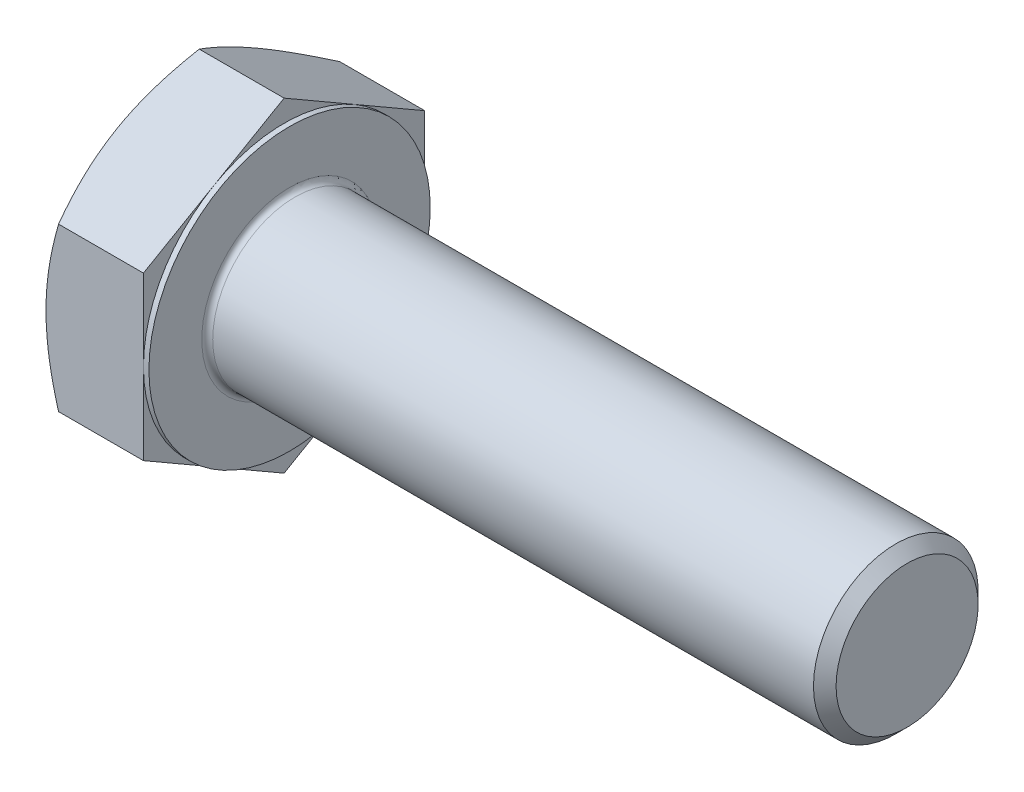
ISO-10303-21;
HEADER;
FILE_DESCRIPTION(('STEP AP214'),'2;1');
FILE_NAME('part.step','',(''),(''),'','','');
FILE_SCHEMA(('AUTOMOTIVE_DESIGN { 1 0 10303 214 1 1 1 1 }'));
ENDSEC;
DATA;
#1=APPLICATION_CONTEXT('core data for automotive mechanical design processes');
#2=APPLICATION_PROTOCOL_DEFINITION('international standard','automotive_design',2000,#1);
#3=PRODUCT_CONTEXT('',#1,'mechanical');
#4=PRODUCT('Part','Part','',(#3));
#5=PRODUCT_RELATED_PRODUCT_CATEGORY('part','',(#4));
#6=PRODUCT_DEFINITION_FORMATION('','',#4);
#7=PRODUCT_DEFINITION_CONTEXT('part definition',#1,'design');
#8=PRODUCT_DEFINITION('design','',#6,#7);
#9=PRODUCT_DEFINITION_SHAPE('','',#8);
#10=(LENGTH_UNIT() NAMED_UNIT(*) SI_UNIT(.MILLI.,.METRE.));
#11=(NAMED_UNIT(*) PLANE_ANGLE_UNIT() SI_UNIT($,.RADIAN.));
#12=(NAMED_UNIT(*) SI_UNIT($,.STERADIAN.) SOLID_ANGLE_UNIT());
#13=UNCERTAINTY_MEASURE_WITH_UNIT(LENGTH_MEASURE(1.E-05),#10,'distance_accuracy_value','');
#14=(GEOMETRIC_REPRESENTATION_CONTEXT(3) GLOBAL_UNCERTAINTY_ASSIGNED_CONTEXT((#13)) GLOBAL_UNIT_ASSIGNED_CONTEXT((#10,
#11,#12)) REPRESENTATION_CONTEXT('',''));
#15=CARTESIAN_POINT('',(0.,0.,0.));
#16=DIRECTION('',(0.,0.,1.));
#17=DIRECTION('',(1.,0.,0.));
#18=AXIS2_PLACEMENT_3D('',#15,#16,#17);
#19=CARTESIAN_POINT('',(15.,35.507041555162,-20.5));
#20=DIRECTION('',(1.,0.,0.));
#21=DIRECTION('',(0.,0.,-1.));
#22=AXIS2_PLACEMENT_3D('',#19,#20,#21);
#23=PLANE('',#22);
#24=CARTESIAN_POINT('',(15.,0.,0.));
#25=DIRECTION('',(1.,0.,0.));
#26=DIRECTION('',(0.,0.,-1.));
#27=AXIS2_PLACEMENT_3D('',#24,#25,#26);
#28=CIRCLE('',#27,12.8);
#29=CARTESIAN_POINT('',(15.,0.,-12.8));
#30=VERTEX_POINT('',#29);
#31=EDGE_CURVE('E42',#30,#30,#28,.F.);
#32=ORIENTED_EDGE('',*,*,#31,.T.);
#33=EDGE_LOOP('',(#32));
#34=FACE_BOUND('',#33,.T.);
#35=CARTESIAN_POINT('',(15.,0.,0.));
#36=DIRECTION('',(1.,0.,0.));
#37=DIRECTION('',(0.,0.,-1.));
#38=AXIS2_PLACEMENT_3D('',#35,#36,#37);
#39=CIRCLE('',#38,20.5);
#40=CARTESIAN_POINT('',(15.,0.,-20.5));
#41=VERTEX_POINT('',#40);
#42=EDGE_CURVE('E165',#41,#41,#39,.T.);
#43=ORIENTED_EDGE('',*,*,#42,.T.);
#44=EDGE_LOOP('',(#43));
#45=FACE_BOUND('',#44,.T.);
#46=ADVANCED_FACE('F34',(#34,#45),#23,.T.);
#47=CARTESIAN_POINT('',(105.,0.,0.));
#48=DIRECTION('',(-1.,0.,0.));
#49=DIRECTION('',(0.,0.,1.));
#50=AXIS2_PLACEMENT_3D('',#47,#48,#49);
#51=PLANE('',#50);
#52=CARTESIAN_POINT('',(105.,0.,0.));
#53=DIRECTION('',(-1.,0.,0.));
#54=DIRECTION('',(0.,0.,1.));
#55=AXIS2_PLACEMENT_3D('',#52,#53,#54);
#56=CIRCLE('',#55,10.352);
#57=CARTESIAN_POINT('',(105.,0.,10.352));
#58=VERTEX_POINT('',#57);
#59=EDGE_CURVE('E318',#58,#58,#56,.T.);
#60=ORIENTED_EDGE('',*,*,#59,.F.);
#61=EDGE_LOOP('',(#60));
#62=FACE_BOUND('',#61,.T.);
#63=ADVANCED_FACE('F276',(#62),#51,.F.);
#64=CARTESIAN_POINT('',(105.,0.,0.));
#65=DIRECTION('',(-1.,0.,0.));
#66=DIRECTION('',(0.,0.,1.));
#67=AXIS2_PLACEMENT_3D('',#64,#65,#66);
#68=CONICAL_SURFACE('',#67,10.352,0.78539816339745);
#69=CARTESIAN_POINT('',(103.352,0.,0.));
#70=DIRECTION('',(-1.,0.,0.));
#71=DIRECTION('',(0.,0.,1.));
#72=AXIS2_PLACEMENT_3D('',#69,#70,#71);
#73=CIRCLE('',#72,12.);
#74=CARTESIAN_POINT('',(103.352,0.,12.));
#75=VERTEX_POINT('',#74);
#76=EDGE_CURVE('E316',#75,#75,#73,.T.);
#77=ORIENTED_EDGE('',*,*,#76,.F.);
#78=EDGE_LOOP('',(#77));
#79=FACE_BOUND('',#78,.T.);
#80=ORIENTED_EDGE('',*,*,#59,.T.);
#81=EDGE_LOOP('',(#80));
#82=FACE_BOUND('',#81,.T.);
#83=ADVANCED_FACE('F281',(#79,#82),#68,.T.);
#84=CARTESIAN_POINT('',(0.,0.,0.));
#85=DIRECTION('',(-1.,0.,0.));
#86=DIRECTION('',(0.,0.,1.));
#87=AXIS2_PLACEMENT_3D('',#84,#85,#86);
#88=CYLINDRICAL_SURFACE('',#87,12.);
#89=CARTESIAN_POINT('',(15.8,0.,0.));
#90=DIRECTION('',(1.,0.,0.));
#91=DIRECTION('',(0.,0.,-1.));
#92=AXIS2_PLACEMENT_3D('',#89,#90,#91);
#93=CIRCLE('',#92,12.);
#94=CARTESIAN_POINT('',(15.8,0.,-12.));
#95=VERTEX_POINT('',#94);
#96=EDGE_CURVE('E11',#95,#95,#93,.T.);
#97=ORIENTED_EDGE('',*,*,#96,.T.);
#98=EDGE_LOOP('',(#97));
#99=FACE_BOUND('',#98,.T.);
#100=ORIENTED_EDGE('',*,*,#76,.T.);
#101=EDGE_LOOP('',(#100));
#102=FACE_BOUND('',#101,.T.);
#103=ADVANCED_FACE('F233',(#99,#102),#88,.T.);
#104=CARTESIAN_POINT('',(14.2,23.6713610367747,0.));
#105=DIRECTION('',(1.,0.,0.));
#106=DIRECTION('',(0.,0.,-1.));
#107=AXIS2_PLACEMENT_3D('',#104,#105,#106);
#108=PLANE('',#107);
#109=DIRECTION('',(0.,1.,0.));
#110=VECTOR('',#109,1.);
#111=CARTESIAN_POINT('',(14.2,-11.8356805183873,-20.5));
#112=LINE('',#111,#110);
#113=CARTESIAN_POINT('',(14.2,-11.8356805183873,-20.5));
#114=VERTEX_POINT('',#113);
#115=CARTESIAN_POINT('',(14.2,0.,-20.5));
#116=VERTEX_POINT('',#115);
#117=EDGE_CURVE('E190',#114,#116,#112,.T.);
#118=ORIENTED_EDGE('',*,*,#117,.T.);
#119=CARTESIAN_POINT('',(14.2,0.,0.));
#120=DIRECTION('',(-1.,0.,0.));
#121=DIRECTION('',(0.,0.,1.));
#122=AXIS2_PLACEMENT_3D('',#119,#120,#121);
#123=CIRCLE('',#122,20.5);
#124=CARTESIAN_POINT('',(14.2,-17.753520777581,-10.25));
#125=VERTEX_POINT('',#124);
#126=EDGE_CURVE('E49',#116,#125,#123,.T.);
#127=ORIENTED_EDGE('',*,*,#126,.T.);
#128=DIRECTION('',(0.,0.5,-0.866025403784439));
#129=VECTOR('',#128,1.);
#130=CARTESIAN_POINT('',(14.2,-23.6713610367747,0.));
#131=LINE('',#130,#129);
#132=EDGE_CURVE('E168',#125,#114,#131,.T.);
#133=ORIENTED_EDGE('',*,*,#132,.T.);
#134=EDGE_LOOP('',(#118,#127,#133));
#135=FACE_BOUND('',#134,.T.);
#136=ADVANCED_FACE('F189',(#135),#108,.T.);
#137=CARTESIAN_POINT('',(14.2,11.8356805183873,-20.5));
#138=VERTEX_POINT('',#137);
#139=EDGE_CURVE('E197',#116,#138,#112,.T.);
#140=ORIENTED_EDGE('',*,*,#139,.T.);
#141=DIRECTION('',(0.,0.5,0.866025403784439));
#142=VECTOR('',#141,1.);
#143=CARTESIAN_POINT('',(14.2,11.8356805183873,-20.5));
#144=LINE('',#143,#142);
#145=CARTESIAN_POINT('',(14.2,17.753520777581,-10.25));
#146=VERTEX_POINT('',#145);
#147=EDGE_CURVE('E203',#138,#146,#144,.T.);
#148=ORIENTED_EDGE('',*,*,#147,.T.);
#149=EDGE_CURVE('E336',#146,#116,#123,.T.);
#150=ORIENTED_EDGE('',*,*,#149,.T.);
#151=EDGE_LOOP('',(#140,#148,#150));
#152=FACE_BOUND('',#151,.T.);
#153=ADVANCED_FACE('F340',(#152),#108,.T.);
#154=CARTESIAN_POINT('',(14.2,23.6713610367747,0.));
#155=VERTEX_POINT('',#154);
#156=EDGE_CURVE('E205',#146,#155,#144,.T.);
#157=ORIENTED_EDGE('',*,*,#156,.T.);
#158=DIRECTION('',(0.,-0.5,0.866025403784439));
#159=VECTOR('',#158,1.);
#160=CARTESIAN_POINT('',(14.2,23.6713610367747,0.));
#161=LINE('',#160,#159);
#162=CARTESIAN_POINT('',(14.2,17.753520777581,10.25));
#163=VERTEX_POINT('',#162);
#164=EDGE_CURVE('E135',#155,#163,#161,.T.);
#165=ORIENTED_EDGE('',*,*,#164,.T.);
#166=EDGE_CURVE('E333',#163,#146,#123,.T.);
#167=ORIENTED_EDGE('',*,*,#166,.T.);
#168=EDGE_LOOP('',(#157,#165,#167));
#169=FACE_BOUND('',#168,.T.);
#170=ADVANCED_FACE('F346',(#169),#108,.T.);
#171=CARTESIAN_POINT('',(14.2,11.8356805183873,20.5));
#172=VERTEX_POINT('',#171);
#173=EDGE_CURVE('E125',#163,#172,#161,.T.);
#174=ORIENTED_EDGE('',*,*,#173,.T.);
#175=DIRECTION('',(0.,-1.,0.));
#176=VECTOR('',#175,1.);
#177=CARTESIAN_POINT('',(14.2,11.8356805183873,20.5));
#178=LINE('',#177,#176);
#179=CARTESIAN_POINT('',(14.2,0.,20.5));
#180=VERTEX_POINT('',#179);
#181=EDGE_CURVE('E128',#172,#180,#178,.T.);
#182=ORIENTED_EDGE('',*,*,#181,.T.);
#183=EDGE_CURVE('E131',#180,#163,#123,.T.);
#184=ORIENTED_EDGE('',*,*,#183,.T.);
#185=EDGE_LOOP('',(#174,#182,#184));
#186=FACE_BOUND('',#185,.T.);
#187=ADVANCED_FACE('F127',(#186),#108,.T.);
#188=CARTESIAN_POINT('',(14.2,-11.8356805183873,20.5));
#189=VERTEX_POINT('',#188);
#190=EDGE_CURVE('E144',#180,#189,#178,.T.);
#191=ORIENTED_EDGE('',*,*,#190,.T.);
#192=DIRECTION('',(0.,-0.5,-0.866025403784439));
#193=VECTOR('',#192,1.);
#194=CARTESIAN_POINT('',(14.2,-11.8356805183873,20.5));
#195=LINE('',#194,#193);
#196=CARTESIAN_POINT('',(14.2,-17.753520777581,10.25));
#197=VERTEX_POINT('',#196);
#198=EDGE_CURVE('E328',#189,#197,#195,.T.);
#199=ORIENTED_EDGE('',*,*,#198,.T.);
#200=EDGE_CURVE('E334',#197,#180,#123,.T.);
#201=ORIENTED_EDGE('',*,*,#200,.T.);
#202=EDGE_LOOP('',(#191,#199,#201));
#203=FACE_BOUND('',#202,.T.);
#204=ADVANCED_FACE('F409',(#203),#108,.T.);
#205=CARTESIAN_POINT('',(14.2,-23.6713610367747,0.));
#206=VERTEX_POINT('',#205);
#207=EDGE_CURVE('E181',#197,#206,#195,.T.);
#208=ORIENTED_EDGE('',*,*,#207,.T.);
#209=EDGE_CURVE('E169',#206,#125,#131,.T.);
#210=ORIENTED_EDGE('',*,*,#209,.T.);
#211=EDGE_CURVE('E179',#125,#197,#123,.T.);
#212=ORIENTED_EDGE('',*,*,#211,.T.);
#213=EDGE_LOOP('',(#208,#210,#212));
#214=FACE_BOUND('',#213,.T.);
#215=ADVANCED_FACE('F178',(#214),#108,.T.);
#216=CARTESIAN_POINT('',(0.,0.,0.));
#217=DIRECTION('',(-1.,0.,0.));
#218=DIRECTION('',(0.,0.,1.));
#219=AXIS2_PLACEMENT_3D('',#216,#217,#218);
#220=CYLINDRICAL_SURFACE('',#219,20.5);
#221=ORIENTED_EDGE('',*,*,#126,.F.);
#222=ORIENTED_EDGE('',*,*,#149,.F.);
#223=ORIENTED_EDGE('',*,*,#166,.F.);
#224=ORIENTED_EDGE('',*,*,#183,.F.);
#225=ORIENTED_EDGE('',*,*,#200,.F.);
#226=ORIENTED_EDGE('',*,*,#211,.F.);
#227=EDGE_LOOP('',(#221,#222,#223,#224,#225,#226));
#228=FACE_BOUND('',#227,.T.);
#229=ORIENTED_EDGE('',*,*,#42,.F.);
#230=EDGE_LOOP('',(#229));
#231=FACE_BOUND('',#230,.T.);
#232=ADVANCED_FACE('F288',(#228,#231),#220,.T.);
#233=CARTESIAN_POINT('',(0.,35.507041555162,-20.5));
#234=DIRECTION('',(1.,0.,0.));
#235=DIRECTION('',(0.,0.,-1.));
#236=AXIS2_PLACEMENT_3D('',#233,#234,#235);
#237=PLANE('',#236);
#238=CARTESIAN_POINT('',(0.,0.,0.));
#239=DIRECTION('',(1.,0.,0.));
#240=DIRECTION('',(0.,0.,-1.));
#241=AXIS2_PLACEMENT_3D('',#238,#239,#240);
#242=CIRCLE('',#241,20.5);
#243=CARTESIAN_POINT('',(0.,0.,-20.5));
#244=VERTEX_POINT('',#243);
#245=CARTESIAN_POINT('',(0.,17.753520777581,-10.25));
#246=VERTEX_POINT('',#245);
#247=EDGE_CURVE('E164',#244,#246,#242,.T.);
#248=ORIENTED_EDGE('',*,*,#247,.F.);
#249=CARTESIAN_POINT('',(0.,-17.753520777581,-10.25));
#250=VERTEX_POINT('',#249);
#251=EDGE_CURVE('E160',#250,#244,#242,.T.);
#252=ORIENTED_EDGE('',*,*,#251,.F.);
#253=CARTESIAN_POINT('',(0.,-17.753520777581,10.25));
#254=VERTEX_POINT('',#253);
#255=EDGE_CURVE('E163',#254,#250,#242,.T.);
#256=ORIENTED_EDGE('',*,*,#255,.F.);
#257=CARTESIAN_POINT('',(0.,0.,20.5));
#258=VERTEX_POINT('',#257);
#259=EDGE_CURVE('E522',#258,#254,#242,.T.);
#260=ORIENTED_EDGE('',*,*,#259,.F.);
#261=CARTESIAN_POINT('',(0.,0.,0.));
#262=DIRECTION('',(-1.,0.,0.));
#263=DIRECTION('',(0.,0.,1.));
#264=AXIS2_PLACEMENT_3D('',#261,#262,#263);
#265=CIRCLE('',#264,20.5);
#266=CARTESIAN_POINT('',(0.,17.753520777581,10.25));
#267=VERTEX_POINT('',#266);
#268=EDGE_CURVE('E198',#258,#267,#265,.T.);
#269=ORIENTED_EDGE('',*,*,#268,.T.);
#270=EDGE_CURVE('E300',#246,#267,#242,.T.);
#271=ORIENTED_EDGE('',*,*,#270,.F.);
#272=EDGE_LOOP('',(#248,#252,#256,#260,#269,#271));
#273=FACE_BOUND('',#272,.T.);
#274=ADVANCED_FACE('F285',(#273),#237,.F.);
#275=CARTESIAN_POINT('',(0.,0.,0.));
#276=DIRECTION('',(1.,0.,0.));
#277=DIRECTION('',(0.,0.,-1.));
#278=AXIS2_PLACEMENT_3D('',#275,#276,#277);
#279=CONICAL_SURFACE('',#278,20.5,1.0471975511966);
#280=CARTESIAN_POINT('',(1.83105281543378,23.6714765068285,0.000199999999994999));
#281=CARTESIAN_POINT('',(1.68086967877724,23.4113332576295,-0.450381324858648));
#282=CARTESIAN_POINT('',(1.53750164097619,23.1501753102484,-0.902720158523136));
#283=CARTESIAN_POINT('',(1.26629011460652,22.6257652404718,-1.81102504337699));
#284=CARTESIAN_POINT('',(1.13845173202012,22.3625124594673,-2.26699223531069));
#285=CARTESIAN_POINT('',(0.90001793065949,21.8334039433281,-3.1834350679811));
#286=CARTESIAN_POINT('',(0.789463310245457,21.5675435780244,-3.6439187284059));
#287=CARTESIAN_POINT('',(0.587971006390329,21.0339755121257,-4.5680857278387));
#288=CARTESIAN_POINT('',(0.497032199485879,20.7662679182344,-5.03176888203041));
#289=CARTESIAN_POINT('',(0.338639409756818,20.2358649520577,-5.95045376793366));
#290=CARTESIAN_POINT('',(0.270661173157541,19.9732089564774,-6.40538729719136));
#291=CARTESIAN_POINT('',(0.156677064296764,19.4466934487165,-7.3173389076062));
#292=CARTESIAN_POINT('',(0.110671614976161,19.1828339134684,-7.77435702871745));
#293=CARTESIAN_POINT('',(0.0417946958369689,18.6546716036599,-8.68916098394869));
#294=CARTESIAN_POINT('',(0.0188957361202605,18.3903697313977,-9.14694525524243));
#295=CARTESIAN_POINT('',(-0.00327576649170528,17.8615220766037,-10.0629362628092));
#296=CARTESIAN_POINT('',(-0.00254903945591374,17.5969763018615,-10.5211429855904));
#297=CARTESIAN_POINT('',(0.020880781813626,17.1024027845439,-11.3777694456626));
#298=CARTESIAN_POINT('',(0.0407268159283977,16.8723398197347,-11.776250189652));
#299=CARTESIAN_POINT('',(0.0979103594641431,16.412763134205,-12.5722603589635));
#300=CARTESIAN_POINT('',(0.135247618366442,16.1832494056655,-12.9697897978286));
#301=CARTESIAN_POINT('',(0.226766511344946,15.7248559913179,-13.7637504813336));
#302=CARTESIAN_POINT('',(0.280963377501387,15.4959770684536,-14.1601804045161));
#303=CARTESIAN_POINT('',(0.405242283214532,15.0393151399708,-14.9511420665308));
#304=CARTESIAN_POINT('',(0.475324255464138,14.8115321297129,-15.3456738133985));
#305=CARTESIAN_POINT('',(0.711196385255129,14.120031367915,-16.5433882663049));
#306=CARTESIAN_POINT('',(0.900518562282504,13.6582783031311,-17.3431680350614));
#307=CARTESIAN_POINT('',(1.22283076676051,12.9707481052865,-18.5340052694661));
#308=CARTESIAN_POINT('',(1.33654034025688,12.7426182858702,-18.9291377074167));
#309=CARTESIAN_POINT('',(1.57547119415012,12.2879365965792,-19.7166694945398));
#310=CARTESIAN_POINT('',(1.70068922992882,12.0613843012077,-20.1090695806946));
#311=CARTESIAN_POINT('',(1.83105281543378,11.8355650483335,-20.5002));
#312=B_SPLINE_CURVE_WITH_KNOTS('',3,(#280,#281,#282,#283,#284,#285,#286,#287,#288,#289,#290,
#291,#292,#293,#294,#295,#296,#297,#298,#299,#300,#301,#302,#303,#304,#305,#306,#307,#308,#309,
#310,#311),.UNSPECIFIED.,.F.,.F.,(4,2,2,2,2,2,2,2,2,2,2,2,2,2,2,4),(0.,1.62462772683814,
3.24978817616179,4.87872871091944,6.50757592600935,8.09621981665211,9.68489428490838,
11.2716764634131,12.8584096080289,14.2397371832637,15.6210449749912,17.0036043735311,
18.3861579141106,21.2121645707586,22.6227063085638,24.0328515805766),.UNSPECIFIED.);
#313=CARTESIAN_POINT('',(1.83098614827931,11.8356805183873,-20.5));
#314=VERTEX_POINT('',#313);
#315=EDGE_CURVE('E252',#246,#314,#312,.T.);
#316=ORIENTED_EDGE('',*,*,#315,.T.);
#317=CARTESIAN_POINT('',(9.80979745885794,-31.3899689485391,-20.5));
#318=CARTESIAN_POINT('',(9.59226627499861,-30.9399526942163,-20.5));
#319=CARTESIAN_POINT('',(9.37586091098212,-30.4893925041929,-20.5));
#320=CARTESIAN_POINT('',(8.94556023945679,-29.5870693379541,-20.5));
#321=CARTESIAN_POINT('',(8.73166495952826,-29.1353063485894,-20.5));
#322=CARTESIAN_POINT('',(8.09406991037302,-27.7779085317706,-20.5));
#323=CARTESIAN_POINT('',(7.67453183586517,-26.870311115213,-20.5));
#324=CARTESIAN_POINT('',(6.84686142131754,-25.0436509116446,-20.5));
#325=CARTESIAN_POINT('',(6.43880809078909,-24.1245522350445,-20.5));
#326=CARTESIAN_POINT('',(5.64022131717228,-22.2788016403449,-20.5));
#327=CARTESIAN_POINT('',(5.24968696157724,-21.3521501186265,-20.5));
#328=CARTESIAN_POINT('',(4.48617156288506,-19.4783167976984,-20.5));
#329=CARTESIAN_POINT('',(4.1134648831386,-18.5310226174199,-20.5));
#330=CARTESIAN_POINT('',(3.3972405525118,-16.625254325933,-20.5));
#331=CARTESIAN_POINT('',(3.05372614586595,-15.6667789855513,-20.5));
#332=CARTESIAN_POINT('',(2.40512113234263,-13.7391236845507,-20.5));
#333=CARTESIAN_POINT('',(2.09994883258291,-12.7699714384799,-20.5));
#334=CARTESIAN_POINT('',(1.53792390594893,-10.8177954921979,-20.5));
#335=CARTESIAN_POINT('',(1.28105601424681,-9.83477628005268,-20.5));
#336=CARTESIAN_POINT('',(0.941385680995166,-8.34966043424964,-20.5));
#337=CARTESIAN_POINT('',(0.835750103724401,-7.8527518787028,-20.5));
#338=CARTESIAN_POINT('',(0.641357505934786,-6.85562756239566,-20.5));
#339=CARTESIAN_POINT('',(0.552600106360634,-6.35541187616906,-20.5));
#340=CARTESIAN_POINT('',(0.393537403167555,-5.35200901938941,-20.5));
#341=CARTESIAN_POINT('',(0.323233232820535,-4.84882166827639,-20.5));
#342=CARTESIAN_POINT('',(0.202489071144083,-3.84005205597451,-20.5));
#343=CARTESIAN_POINT('',(0.15204910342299,-3.33446979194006,-20.5));
#344=CARTESIAN_POINT('',(0.0723912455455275,-2.32485722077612,-20.5));
#345=CARTESIAN_POINT('',(0.0430405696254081,-1.82083745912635,-20.5));
#346=CARTESIAN_POINT('',(0.00571561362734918,-0.812009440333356,-20.5));
#347=CARTESIAN_POINT('',(-0.00225898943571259,-0.307201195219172,-20.5));
#348=CARTESIAN_POINT('',(0.00335727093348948,0.702157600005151,-20.5));
#349=CARTESIAN_POINT('',(0.0169421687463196,1.20670818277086,-20.5));
#350=CARTESIAN_POINT('',(0.0653398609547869,2.21479394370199,-20.5));
#351=CARTESIAN_POINT('',(0.100153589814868,2.71832907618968,-20.5));
#352=CARTESIAN_POINT('',(0.209497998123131,3.93836780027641,-20.5));
#353=CARTESIAN_POINT('',(0.294643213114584,4.65393563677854,-20.5));
#354=CARTESIAN_POINT('',(0.503069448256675,6.07950291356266,-20.5));
#355=CARTESIAN_POINT('',(0.626356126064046,6.78950151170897,-20.5));
#356=CARTESIAN_POINT('',(0.906871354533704,8.20429219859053,-20.5));
#357=CARTESIAN_POINT('',(1.06417266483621,8.90906972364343,-20.5));
#358=CARTESIAN_POINT('',(1.40783262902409,10.3114091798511,-20.5));
#359=CARTESIAN_POINT('',(1.59419019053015,11.0089713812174,-20.5));
#360=CARTESIAN_POINT('',(1.99616156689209,12.4133077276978,-20.5));
#361=CARTESIAN_POINT('',(2.21235967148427,13.1199134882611,-20.5));
#362=CARTESIAN_POINT('',(2.66628065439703,14.5262025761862,-20.5));
#363=CARTESIAN_POINT('',(2.90400547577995,15.225885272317,-20.5));
#364=CARTESIAN_POINT('',(3.39595115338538,16.614963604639,-20.5));
#365=CARTESIAN_POINT('',(3.65007142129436,17.3043950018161,-20.5));
#366=CARTESIAN_POINT('',(4.04225268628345,18.3341949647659,-20.5));
#367=CARTESIAN_POINT('',(4.1747910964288,18.6766824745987,-20.5));
#368=CARTESIAN_POINT('',(4.44323659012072,19.3603241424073,-20.5));
#369=CARTESIAN_POINT('',(4.57914357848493,19.7014783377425,-20.5));
#370=CARTESIAN_POINT('',(4.71658365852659,20.0420145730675,-20.5));
#371=B_SPLINE_CURVE_WITH_KNOTS('',3,(#317,#318,#319,#320,#321,#322,#323,#324,#325,#326,#327,
#328,#329,#330,#331,#332,#333,#334,#335,#336,#337,#338,#339,#340,#341,#342,#343,#344,#345,#346,
#347,#348,#349,#350,#351,#352,#353,#354,#355,#356,#357,#358,#359,#360,#361,#362,#363,#364,#365,
#366,#367,#368,#369,#370),.UNSPECIFIED.,.F.,.F.,(4,2,2,2,2,2,2,2,2,2,2,2,2,2,2,2,2,2,2,2,2,2,2,
2,2,2,4),(0.,1.4995003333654,2.99901712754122,5.99853830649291,9.01522453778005,
12.0317534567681,15.0853160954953,18.139217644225,21.1864979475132,24.232813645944,
25.7566114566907,27.2803750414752,28.804232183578,30.3280911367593,31.8422691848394,
33.35642435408,34.870160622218,36.3839635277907,38.5446079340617,40.7055729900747,
42.8712070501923,45.0367597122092,47.2531694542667,49.4697794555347,51.6738890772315,
52.7755902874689,53.8772604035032),.UNSPECIFIED.);
#372=EDGE_CURVE('E303',#314,#244,#371,.F.);
#373=ORIENTED_EDGE('',*,*,#372,.T.);
#374=ORIENTED_EDGE('',*,*,#247,.T.);
#375=EDGE_LOOP('',(#316,#373,#374));
#376=FACE_BOUND('',#375,.T.);
#377=ADVANCED_FACE('F287',(#376),#279,.T.);
#378=CARTESIAN_POINT('',(1.83105281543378,11.8355650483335,20.5002));
#379=CARTESIAN_POINT('',(1.68086967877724,12.0957082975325,20.0496186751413));
#380=CARTESIAN_POINT('',(1.53750164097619,12.3568662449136,19.5972798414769));
#381=CARTESIAN_POINT('',(1.26629011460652,12.8812763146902,18.688974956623));
#382=CARTESIAN_POINT('',(1.13845173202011,13.1445290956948,18.2330077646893));
#383=CARTESIAN_POINT('',(0.900017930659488,13.6736376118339,17.3165649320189));
#384=CARTESIAN_POINT('',(0.789463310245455,13.9394979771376,16.8560812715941));
#385=CARTESIAN_POINT('',(0.587971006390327,14.4730660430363,15.9319142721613));
#386=CARTESIAN_POINT('',(0.497032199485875,14.7407736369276,15.4682311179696));
#387=CARTESIAN_POINT('',(0.338639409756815,15.2711766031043,14.5495462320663));
#388=CARTESIAN_POINT('',(0.27066117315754,15.5338325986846,14.0946127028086));
#389=CARTESIAN_POINT('',(0.156677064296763,16.0603481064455,13.1826610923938));
#390=CARTESIAN_POINT('',(0.110671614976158,16.3242076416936,12.7256429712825));
#391=CARTESIAN_POINT('',(0.0417946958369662,16.8523699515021,11.8108390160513));
#392=CARTESIAN_POINT('',(0.018895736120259,17.1166718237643,11.3530547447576));
#393=CARTESIAN_POINT('',(-0.00327576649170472,17.6455194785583,10.4370637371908));
#394=CARTESIAN_POINT('',(-0.00254903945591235,17.9100652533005,9.97885701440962));
#395=CARTESIAN_POINT('',(0.0208807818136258,18.4046387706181,9.12223055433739));
#396=CARTESIAN_POINT('',(0.0407268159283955,18.6347017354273,8.72374981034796));
#397=CARTESIAN_POINT('',(0.0979103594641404,19.094278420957,7.92773964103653));
#398=CARTESIAN_POINT('',(0.135247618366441,19.3237921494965,7.5302102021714));
#399=CARTESIAN_POINT('',(0.226766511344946,19.7821855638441,6.73624951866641));
#400=CARTESIAN_POINT('',(0.280963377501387,20.0110644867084,6.33981959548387));
#401=CARTESIAN_POINT('',(0.405242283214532,20.4677264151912,5.54885793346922));
#402=CARTESIAN_POINT('',(0.475324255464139,20.6955094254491,5.15432618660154));
#403=CARTESIAN_POINT('',(0.71119638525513,21.387010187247,3.95661173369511));
#404=CARTESIAN_POINT('',(0.900518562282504,21.8487632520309,3.1568319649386));
#405=CARTESIAN_POINT('',(1.2228307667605,22.5362934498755,1.96599473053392));
#406=CARTESIAN_POINT('',(1.33654034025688,22.7644232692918,1.57086229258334));
#407=CARTESIAN_POINT('',(1.57547119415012,23.2191049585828,0.78333050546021));
#408=CARTESIAN_POINT('',(1.70068922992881,23.4456572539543,0.390930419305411));
#409=CARTESIAN_POINT('',(1.83105281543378,23.6714765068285,-0.000200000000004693));
#410=B_SPLINE_CURVE_WITH_KNOTS('',3,(#378,#379,#380,#381,#382,#383,#384,#385,#386,#387,#388,
#389,#390,#391,#392,#393,#394,#395,#396,#397,#398,#399,#400,#401,#402,#403,#404,#405,#406,#407,
#408,#409),.UNSPECIFIED.,.F.,.F.,(4,2,2,2,2,2,2,2,2,2,2,2,2,2,2,4),(0.,1.62462772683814,
3.24978817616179,4.87872871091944,6.50757592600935,8.09621981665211,9.68489428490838,
11.2716764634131,12.8584096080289,14.2397371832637,15.6210449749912,17.0036043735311,
18.3861579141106,21.2121645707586,22.6227063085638,24.0328515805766),.UNSPECIFIED.);
#411=CARTESIAN_POINT('',(1.83098614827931,23.6713610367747,0.));
#412=VERTEX_POINT('',#411);
#413=EDGE_CURVE('E258',#267,#412,#410,.T.);
#414=ORIENTED_EDGE('',*,*,#413,.T.);
#415=EDGE_CURVE('E57',#412,#246,#312,.T.);
#416=ORIENTED_EDGE('',*,*,#415,.T.);
#417=ORIENTED_EDGE('',*,*,#270,.T.);
#418=EDGE_LOOP('',(#414,#416,#417));
#419=FACE_BOUND('',#418,.T.);
#420=ADVANCED_FACE('F229',(#419),#279,.T.);
#421=CARTESIAN_POINT('',(1.83098614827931,11.8356805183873,20.5));
#422=VERTEX_POINT('',#421);
#423=EDGE_CURVE('E149',#422,#267,#410,.T.);
#424=ORIENTED_EDGE('',*,*,#423,.T.);
#425=ORIENTED_EDGE('',*,*,#268,.F.);
#426=CARTESIAN_POINT('',(9.80979745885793,-31.3899689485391,20.5));
#427=CARTESIAN_POINT('',(9.5922662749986,-30.9399526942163,20.5));
#428=CARTESIAN_POINT('',(9.37586091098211,-30.4893925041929,20.5));
#429=CARTESIAN_POINT('',(8.94556023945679,-29.5870693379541,20.5));
#430=CARTESIAN_POINT('',(8.73166495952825,-29.1353063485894,20.5));
#431=CARTESIAN_POINT('',(8.09406991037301,-27.7779085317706,20.5));
#432=CARTESIAN_POINT('',(7.67453183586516,-26.870311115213,20.5));
#433=CARTESIAN_POINT('',(6.84686142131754,-25.0436509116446,20.5));
#434=CARTESIAN_POINT('',(6.43880809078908,-24.1245522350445,20.5));
#435=CARTESIAN_POINT('',(5.64022131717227,-22.2788016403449,20.5));
#436=CARTESIAN_POINT('',(5.24968696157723,-21.3521501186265,20.5));
#437=CARTESIAN_POINT('',(4.48617156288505,-19.4783167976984,20.5));
#438=CARTESIAN_POINT('',(4.11346488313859,-18.5310226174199,20.5));
#439=CARTESIAN_POINT('',(3.39724055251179,-16.625254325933,20.5));
#440=CARTESIAN_POINT('',(3.05372614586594,-15.6667789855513,20.5));
#441=CARTESIAN_POINT('',(2.40512113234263,-13.7391236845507,20.5));
#442=CARTESIAN_POINT('',(2.0999488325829,-12.7699714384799,20.5));
#443=CARTESIAN_POINT('',(1.53792390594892,-10.8177954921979,20.5));
#444=CARTESIAN_POINT('',(1.2810560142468,-9.83477628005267,20.5));
#445=CARTESIAN_POINT('',(0.94138568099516,-8.34966043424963,20.5));
#446=CARTESIAN_POINT('',(0.835750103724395,-7.85275187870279,20.5));
#447=CARTESIAN_POINT('',(0.64135750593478,-6.85562756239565,20.5));
#448=CARTESIAN_POINT('',(0.552600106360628,-6.35541187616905,20.5));
#449=CARTESIAN_POINT('',(0.39353740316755,-5.35200901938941,20.5));
#450=CARTESIAN_POINT('',(0.323233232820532,-4.84882166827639,20.5));
#451=CARTESIAN_POINT('',(0.202489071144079,-3.84005205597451,20.5));
#452=CARTESIAN_POINT('',(0.152049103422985,-3.33446979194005,20.5));
#453=CARTESIAN_POINT('',(0.0723912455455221,-2.32485722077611,20.5));
#454=CARTESIAN_POINT('',(0.0430405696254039,-1.82083745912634,20.5));
#455=CARTESIAN_POINT('',(0.00571561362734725,-0.812009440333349,20.5));
#456=CARTESIAN_POINT('',(-0.00225898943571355,-0.307201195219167,20.5));
#457=CARTESIAN_POINT('',(0.00335727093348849,0.702157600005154,20.5));
#458=CARTESIAN_POINT('',(0.0169421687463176,1.20670818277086,20.5));
#459=CARTESIAN_POINT('',(0.0653398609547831,2.21479394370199,20.5));
#460=CARTESIAN_POINT('',(0.100153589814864,2.71832907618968,20.5));
#461=CARTESIAN_POINT('',(0.209497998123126,3.93836780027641,20.5));
#462=CARTESIAN_POINT('',(0.294643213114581,4.65393563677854,20.5));
#463=CARTESIAN_POINT('',(0.503069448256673,6.07950291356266,20.5));
#464=CARTESIAN_POINT('',(0.626356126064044,6.78950151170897,20.5));
#465=CARTESIAN_POINT('',(0.906871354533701,8.20429219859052,20.5));
#466=CARTESIAN_POINT('',(1.06417266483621,8.90906972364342,20.5));
#467=CARTESIAN_POINT('',(1.40783262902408,10.3114091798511,20.5));
#468=CARTESIAN_POINT('',(1.59419019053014,11.0089713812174,20.5));
#469=CARTESIAN_POINT('',(1.99616156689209,12.4133077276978,20.5));
#470=CARTESIAN_POINT('',(2.21235967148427,13.1199134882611,20.5));
#471=CARTESIAN_POINT('',(2.66628065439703,14.5262025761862,20.5));
#472=CARTESIAN_POINT('',(2.90400547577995,15.225885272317,20.5));
#473=CARTESIAN_POINT('',(3.39595115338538,16.614963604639,20.5));
#474=CARTESIAN_POINT('',(3.65007142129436,17.3043950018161,20.5));
#475=CARTESIAN_POINT('',(4.04225268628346,18.3341949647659,20.5));
#476=CARTESIAN_POINT('',(4.1747910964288,18.6766824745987,20.5));
#477=CARTESIAN_POINT('',(4.44323659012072,19.3603241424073,20.5));
#478=CARTESIAN_POINT('',(4.57914357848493,19.7014783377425,20.5));
#479=CARTESIAN_POINT('',(4.71658365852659,20.0420145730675,20.5));
#480=B_SPLINE_CURVE_WITH_KNOTS('',3,(#426,#427,#428,#429,#430,#431,#432,#433,#434,#435,#436,
#437,#438,#439,#440,#441,#442,#443,#444,#445,#446,#447,#448,#449,#450,#451,#452,#453,#454,#455,
#456,#457,#458,#459,#460,#461,#462,#463,#464,#465,#466,#467,#468,#469,#470,#471,#472,#473,#474,
#475,#476,#477,#478,#479),.UNSPECIFIED.,.F.,.F.,(4,2,2,2,2,2,2,2,2,2,2,2,2,2,2,2,2,2,2,2,2,2,2,
2,2,2,4),(0.,1.4995003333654,2.99901712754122,5.99853830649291,9.01522453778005,
12.0317534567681,15.0853160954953,18.139217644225,21.1864979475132,24.2328136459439,
25.7566114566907,27.2803750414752,28.804232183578,30.3280911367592,31.8422691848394,
33.35642435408,34.870160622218,36.3839635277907,38.5446079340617,40.7055729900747,
42.8712070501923,45.0367597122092,47.2531694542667,49.4697794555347,51.6738890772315,
52.7755902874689,53.8772604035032),.UNSPECIFIED.);
#481=EDGE_CURVE('E314',#258,#422,#480,.T.);
#482=ORIENTED_EDGE('',*,*,#481,.T.);
#483=EDGE_LOOP('',(#424,#425,#482));
#484=FACE_BOUND('',#483,.T.);
#485=ADVANCED_FACE('F223',(#484),#279,.T.);
#486=CARTESIAN_POINT('',(1.83098614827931,-11.8356805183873,20.5));
#487=VERTEX_POINT('',#486);
#488=EDGE_CURVE('E246',#487,#258,#480,.T.);
#489=ORIENTED_EDGE('',*,*,#488,.T.);
#490=ORIENTED_EDGE('',*,*,#259,.T.);
#491=CARTESIAN_POINT('',(1.83105281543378,-23.6714765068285,-0.000200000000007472));
#492=CARTESIAN_POINT('',(1.68086967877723,-23.4113332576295,0.450381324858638));
#493=CARTESIAN_POINT('',(1.53750164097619,-23.1501753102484,0.902720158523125));
#494=CARTESIAN_POINT('',(1.26629011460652,-22.6257652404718,1.81102504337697));
#495=CARTESIAN_POINT('',(1.13845173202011,-22.3625124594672,2.26699223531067));
#496=CARTESIAN_POINT('',(0.900017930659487,-21.8334039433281,3.18343506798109));
#497=CARTESIAN_POINT('',(0.789463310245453,-21.5675435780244,3.64391872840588));
#498=CARTESIAN_POINT('',(0.587971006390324,-21.0339755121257,4.56808572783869));
#499=CARTESIAN_POINT('',(0.497032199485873,-20.7662679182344,5.0317688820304));
#500=CARTESIAN_POINT('',(0.338639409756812,-20.2358649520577,5.95045376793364));
#501=CARTESIAN_POINT('',(0.270661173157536,-19.9732089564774,6.40538729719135));
#502=CARTESIAN_POINT('',(0.156677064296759,-19.4466934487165,7.31733890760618));
#503=CARTESIAN_POINT('',(0.110671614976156,-19.1828339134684,7.77435702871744));
#504=CARTESIAN_POINT('',(0.0417946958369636,-18.6546716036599,8.68916098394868));
#505=CARTESIAN_POINT('',(0.0188957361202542,-18.3903697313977,9.14694525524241));
#506=CARTESIAN_POINT('',(-0.00327576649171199,-17.8615220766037,10.0629362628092));
#507=CARTESIAN_POINT('',(-0.0025490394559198,-17.5969763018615,10.5211429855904));
#508=CARTESIAN_POINT('',(0.0208807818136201,-17.1024027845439,11.3777694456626));
#509=CARTESIAN_POINT('',(0.0407268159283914,-16.8723398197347,11.776250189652));
#510=CARTESIAN_POINT('',(0.0979103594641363,-16.412763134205,12.5722603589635));
#511=CARTESIAN_POINT('',(0.135247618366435,-16.1832494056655,12.9697897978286));
#512=CARTESIAN_POINT('',(0.226766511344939,-15.7248559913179,13.7637504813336));
#513=CARTESIAN_POINT('',(0.280963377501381,-15.4959770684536,14.1601804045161));
#514=CARTESIAN_POINT('',(0.405242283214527,-15.0393151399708,14.9511420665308));
#515=CARTESIAN_POINT('',(0.475324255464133,-14.8115321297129,15.3456738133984));
#516=CARTESIAN_POINT('',(0.711196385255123,-14.120031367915,16.5433882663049));
#517=CARTESIAN_POINT('',(0.900518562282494,-13.658278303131,17.3431680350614));
#518=CARTESIAN_POINT('',(1.2228307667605,-12.9707481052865,18.5340052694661));
#519=CARTESIAN_POINT('',(1.33654034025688,-12.7426182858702,18.9291377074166));
#520=CARTESIAN_POINT('',(1.57547119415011,-12.2879365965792,19.7166694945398));
#521=CARTESIAN_POINT('',(1.70068922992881,-12.0613843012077,20.1090695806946));
#522=CARTESIAN_POINT('',(1.83105281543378,-11.8355650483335,20.5002));
#523=B_SPLINE_CURVE_WITH_KNOTS('',3,(#491,#492,#493,#494,#495,#496,#497,#498,#499,#500,#501,
#502,#503,#504,#505,#506,#507,#508,#509,#510,#511,#512,#513,#514,#515,#516,#517,#518,#519,#520,
#521,#522),.UNSPECIFIED.,.F.,.F.,(4,2,2,2,2,2,2,2,2,2,2,2,2,2,2,4),(0.,1.62462772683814,
3.24978817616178,4.87872871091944,6.50757592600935,8.09621981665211,9.68489428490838,
11.2716764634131,12.8584096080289,14.2397371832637,15.6210449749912,17.0036043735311,
18.3861579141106,21.2121645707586,22.6227063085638,24.0328515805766),.UNSPECIFIED.);
#524=EDGE_CURVE('E305',#254,#487,#523,.T.);
#525=ORIENTED_EDGE('',*,*,#524,.T.);
#526=EDGE_LOOP('',(#489,#490,#525));
#527=FACE_BOUND('',#526,.T.);
#528=ADVANCED_FACE('F228',(#527),#279,.T.);
#529=CARTESIAN_POINT('',(1.83098614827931,-11.8356805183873,-20.5));
#530=VERTEX_POINT('',#529);
#531=EDGE_CURVE('E241',#244,#530,#371,.F.);
#532=ORIENTED_EDGE('',*,*,#531,.T.);
#533=CARTESIAN_POINT('',(1.83105281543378,-11.8355650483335,-20.5002));
#534=CARTESIAN_POINT('',(1.68086967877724,-12.0957082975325,-20.0496186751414));
#535=CARTESIAN_POINT('',(1.53750164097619,-12.3568662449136,-19.5972798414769));
#536=CARTESIAN_POINT('',(1.26629011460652,-12.8812763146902,-18.688974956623));
#537=CARTESIAN_POINT('',(1.13845173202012,-13.1445290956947,-18.2330077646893));
#538=CARTESIAN_POINT('',(0.900017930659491,-13.6736376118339,-17.3165649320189));
#539=CARTESIAN_POINT('',(0.789463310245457,-13.9394979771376,-16.8560812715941));
#540=CARTESIAN_POINT('',(0.587971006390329,-14.4730660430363,-15.9319142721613));
#541=CARTESIAN_POINT('',(0.497032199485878,-14.7407736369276,-15.4682311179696));
#542=CARTESIAN_POINT('',(0.338639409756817,-15.2711766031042,-14.5495462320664));
#543=CARTESIAN_POINT('',(0.27066117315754,-15.5338325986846,-14.0946127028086));
#544=CARTESIAN_POINT('',(0.156677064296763,-16.0603481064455,-13.1826610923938));
#545=CARTESIAN_POINT('',(0.11067161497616,-16.3242076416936,-12.7256429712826));
#546=CARTESIAN_POINT('',(0.0417946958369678,-16.8523699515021,-11.8108390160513));
#547=CARTESIAN_POINT('',(0.0188957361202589,-17.1166718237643,-11.3530547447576));
#548=CARTESIAN_POINT('',(-0.00327576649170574,-17.6455194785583,-10.4370637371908));
#549=CARTESIAN_POINT('',(-0.00254903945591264,-17.9100652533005,-9.97885701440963));
#550=CARTESIAN_POINT('',(0.020880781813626,-18.4046387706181,-9.1222305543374));
#551=CARTESIAN_POINT('',(0.0407268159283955,-18.6347017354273,-8.72374981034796));
#552=CARTESIAN_POINT('',(0.0979103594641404,-19.094278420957,-7.92773964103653));
#553=CARTESIAN_POINT('',(0.135247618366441,-19.3237921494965,-7.53021020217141));
#554=CARTESIAN_POINT('',(0.226766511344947,-19.7821855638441,-6.73624951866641));
#555=CARTESIAN_POINT('',(0.280963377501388,-20.0110644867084,-6.33981959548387));
#556=CARTESIAN_POINT('',(0.405242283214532,-20.4677264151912,-5.54885793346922));
#557=CARTESIAN_POINT('',(0.475324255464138,-20.6955094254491,-5.15432618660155));
#558=CARTESIAN_POINT('',(0.711196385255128,-21.387010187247,-3.95661173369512));
#559=CARTESIAN_POINT('',(0.900518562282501,-21.8487632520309,-3.15683196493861));
#560=CARTESIAN_POINT('',(1.2228307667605,-22.5362934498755,-1.96599473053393));
#561=CARTESIAN_POINT('',(1.33654034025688,-22.7644232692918,-1.57086229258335));
#562=CARTESIAN_POINT('',(1.57547119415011,-23.2191049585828,-0.783330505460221));
#563=CARTESIAN_POINT('',(1.70068922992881,-23.4456572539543,-0.390930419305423));
#564=CARTESIAN_POINT('',(1.83105281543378,-23.6714765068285,0.000199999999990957));
#565=B_SPLINE_CURVE_WITH_KNOTS('',3,(#533,#534,#535,#536,#537,#538,#539,#540,#541,#542,#543,
#544,#545,#546,#547,#548,#549,#550,#551,#552,#553,#554,#555,#556,#557,#558,#559,#560,#561,#562,
#563,#564),.UNSPECIFIED.,.F.,.F.,(4,2,2,2,2,2,2,2,2,2,2,2,2,2,2,4),(0.,1.62462772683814,
3.24978817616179,4.87872871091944,6.50757592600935,8.09621981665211,9.68489428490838,
11.2716764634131,12.8584096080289,14.2397371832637,15.6210449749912,17.0036043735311,
18.3861579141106,21.2121645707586,22.6227063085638,24.0328515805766),.UNSPECIFIED.);
#566=EDGE_CURVE('E214',#530,#250,#565,.T.);
#567=ORIENTED_EDGE('',*,*,#566,.T.);
#568=ORIENTED_EDGE('',*,*,#251,.T.);
#569=EDGE_LOOP('',(#532,#567,#568));
#570=FACE_BOUND('',#569,.T.);
#571=ADVANCED_FACE('F348',(#570),#279,.T.);
#572=CARTESIAN_POINT('',(1.83098614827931,-23.6713610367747,0.));
#573=VERTEX_POINT('',#572);
#574=EDGE_CURVE('E215',#573,#254,#523,.T.);
#575=ORIENTED_EDGE('',*,*,#574,.T.);
#576=ORIENTED_EDGE('',*,*,#255,.T.);
#577=EDGE_CURVE('E201',#250,#573,#565,.T.);
#578=ORIENTED_EDGE('',*,*,#577,.T.);
#579=EDGE_LOOP('',(#575,#576,#578));
#580=FACE_BOUND('',#579,.T.);
#581=ADVANCED_FACE('F231',(#580),#279,.T.);
#582=CARTESIAN_POINT('',(15.,-23.6713610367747,0.));
#583=DIRECTION('',(0.,0.866025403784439,0.5));
#584=DIRECTION('',(0.,-0.5,0.866025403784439));
#585=AXIS2_PLACEMENT_3D('',#582,#583,#584);
#586=PLANE('',#585);
#587=ORIENTED_EDGE('',*,*,#209,.F.);
#588=DIRECTION('',(-1.,0.,0.));
#589=VECTOR('',#588,1.);
#590=CARTESIAN_POINT('',(15.,-23.6713610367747,0.));
#591=LINE('',#590,#589);
#592=EDGE_CURVE('E155',#206,#573,#591,.T.);
#593=ORIENTED_EDGE('',*,*,#592,.T.);
#594=ORIENTED_EDGE('',*,*,#577,.F.);
#595=ORIENTED_EDGE('',*,*,#566,.F.);
#596=DIRECTION('',(-1.,0.,0.));
#597=VECTOR('',#596,1.);
#598=CARTESIAN_POINT('',(15.,-11.8356805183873,-20.5));
#599=LINE('',#598,#597);
#600=EDGE_CURVE('E187',#114,#530,#599,.T.);
#601=ORIENTED_EDGE('',*,*,#600,.F.);
#602=ORIENTED_EDGE('',*,*,#132,.F.);
#603=EDGE_LOOP('',(#587,#593,#594,#595,#601,#602));
#604=FACE_BOUND('',#603,.T.);
#605=ADVANCED_FACE('F185',(#604),#586,.F.);
#606=CARTESIAN_POINT('',(15.,-11.8356805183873,20.5));
#607=DIRECTION('',(0.,0.866025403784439,-0.5));
#608=DIRECTION('',(0.,0.5,0.866025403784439));
#609=AXIS2_PLACEMENT_3D('',#606,#607,#608);
#610=PLANE('',#609);
#611=ORIENTED_EDGE('',*,*,#198,.F.);
#612=DIRECTION('',(-1.,0.,0.));
#613=VECTOR('',#612,1.);
#614=CARTESIAN_POINT('',(15.,-11.8356805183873,20.5));
#615=LINE('',#614,#613);
#616=EDGE_CURVE('E151',#189,#487,#615,.T.);
#617=ORIENTED_EDGE('',*,*,#616,.T.);
#618=ORIENTED_EDGE('',*,*,#524,.F.);
#619=ORIENTED_EDGE('',*,*,#574,.F.);
#620=ORIENTED_EDGE('',*,*,#592,.F.);
#621=ORIENTED_EDGE('',*,*,#207,.F.);
#622=EDGE_LOOP('',(#611,#617,#618,#619,#620,#621));
#623=FACE_BOUND('',#622,.T.);
#624=ADVANCED_FACE('F327',(#623),#610,.F.);
#625=CARTESIAN_POINT('',(15.,11.8356805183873,20.5));
#626=DIRECTION('',(0.,0.,-1.));
#627=DIRECTION('',(-1.,0.,0.));
#628=AXIS2_PLACEMENT_3D('',#625,#626,#627);
#629=PLANE('',#628);
#630=ORIENTED_EDGE('',*,*,#181,.F.);
#631=DIRECTION('',(-1.,0.,0.));
#632=VECTOR('',#631,1.);
#633=CARTESIAN_POINT('',(15.,11.8356805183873,20.5));
#634=LINE('',#633,#632);
#635=EDGE_CURVE('E141',#172,#422,#634,.T.);
#636=ORIENTED_EDGE('',*,*,#635,.T.);
#637=ORIENTED_EDGE('',*,*,#481,.F.);
#638=ORIENTED_EDGE('',*,*,#488,.F.);
#639=ORIENTED_EDGE('',*,*,#616,.F.);
#640=ORIENTED_EDGE('',*,*,#190,.F.);
#641=EDGE_LOOP('',(#630,#636,#637,#638,#639,#640));
#642=FACE_BOUND('',#641,.T.);
#643=ADVANCED_FACE('F139',(#642),#629,.F.);
#644=CARTESIAN_POINT('',(15.,23.6713610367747,0.));
#645=DIRECTION('',(0.,-0.866025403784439,-0.5));
#646=DIRECTION('',(0.,0.5,-0.866025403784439));
#647=AXIS2_PLACEMENT_3D('',#644,#645,#646);
#648=PLANE('',#647);
#649=ORIENTED_EDGE('',*,*,#164,.F.);
#650=DIRECTION('',(-1.,0.,0.));
#651=VECTOR('',#650,1.);
#652=CARTESIAN_POINT('',(15.,23.6713610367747,0.));
#653=LINE('',#652,#651);
#654=EDGE_CURVE('E150',#155,#412,#653,.T.);
#655=ORIENTED_EDGE('',*,*,#654,.T.);
#656=ORIENTED_EDGE('',*,*,#413,.F.);
#657=ORIENTED_EDGE('',*,*,#423,.F.);
#658=ORIENTED_EDGE('',*,*,#635,.F.);
#659=ORIENTED_EDGE('',*,*,#173,.F.);
#660=EDGE_LOOP('',(#649,#655,#656,#657,#658,#659));
#661=FACE_BOUND('',#660,.T.);
#662=ADVANCED_FACE('F147',(#661),#648,.F.);
#663=CARTESIAN_POINT('',(15.,11.8356805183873,-20.5));
#664=DIRECTION('',(0.,-0.866025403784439,0.5));
#665=DIRECTION('',(0.,-0.5,-0.866025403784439));
#666=AXIS2_PLACEMENT_3D('',#663,#664,#665);
#667=PLANE('',#666);
#668=ORIENTED_EDGE('',*,*,#147,.F.);
#669=DIRECTION('',(-1.,0.,0.));
#670=VECTOR('',#669,1.);
#671=CARTESIAN_POINT('',(15.,11.8356805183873,-20.5));
#672=LINE('',#671,#670);
#673=EDGE_CURVE('E153',#138,#314,#672,.T.);
#674=ORIENTED_EDGE('',*,*,#673,.T.);
#675=ORIENTED_EDGE('',*,*,#315,.F.);
#676=ORIENTED_EDGE('',*,*,#415,.F.);
#677=ORIENTED_EDGE('',*,*,#654,.F.);
#678=ORIENTED_EDGE('',*,*,#156,.F.);
#679=EDGE_LOOP('',(#668,#674,#675,#676,#677,#678));
#680=FACE_BOUND('',#679,.T.);
#681=ADVANCED_FACE('F264',(#680),#667,.F.);
#682=CARTESIAN_POINT('',(15.,-11.8356805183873,-20.5));
#683=DIRECTION('',(0.,0.,1.));
#684=DIRECTION('',(0.,-1.,0.));
#685=AXIS2_PLACEMENT_3D('',#682,#683,#684);
#686=PLANE('',#685);
#687=ORIENTED_EDGE('',*,*,#117,.F.);
#688=ORIENTED_EDGE('',*,*,#600,.T.);
#689=ORIENTED_EDGE('',*,*,#531,.F.);
#690=ORIENTED_EDGE('',*,*,#372,.F.);
#691=ORIENTED_EDGE('',*,*,#673,.F.);
#692=ORIENTED_EDGE('',*,*,#139,.F.);
#693=EDGE_LOOP('',(#687,#688,#689,#690,#691,#692));
#694=FACE_BOUND('',#693,.T.);
#695=ADVANCED_FACE('F193',(#694),#686,.F.);
#696=CARTESIAN_POINT('',(15.8,0.,0.));
#697=DIRECTION('',(1.,0.,0.));
#698=DIRECTION('',(0.,0.,-1.));
#699=AXIS2_PLACEMENT_3D('',#696,#697,#698);
#700=TOROIDAL_SURFACE('',#699,12.8,0.8);
#701=ORIENTED_EDGE('',*,*,#96,.F.);
#702=EDGE_LOOP('',(#701));
#703=FACE_BOUND('',#702,.T.);
#704=ORIENTED_EDGE('',*,*,#31,.F.);
#705=EDGE_LOOP('',(#704));
#706=FACE_BOUND('',#705,.T.);
#707=ADVANCED_FACE('F36',(#703,#706),#700,.F.);
#708=CLOSED_SHELL('',(#46,#63,#83,#103,#136,#153,#170,#187,#204,#215,#232,#274,#377,#420,#485,
#528,#571,#581,#605,#624,#643,#662,#681,#695,#707));
#709=MANIFOLD_SOLID_BREP('B2',#708);
#710=ADVANCED_BREP_SHAPE_REPRESENTATION('',(#18,#709),#14);
#711=SHAPE_DEFINITION_REPRESENTATION(#9,#710);
ENDSEC;
END-ISO-10303-21;
